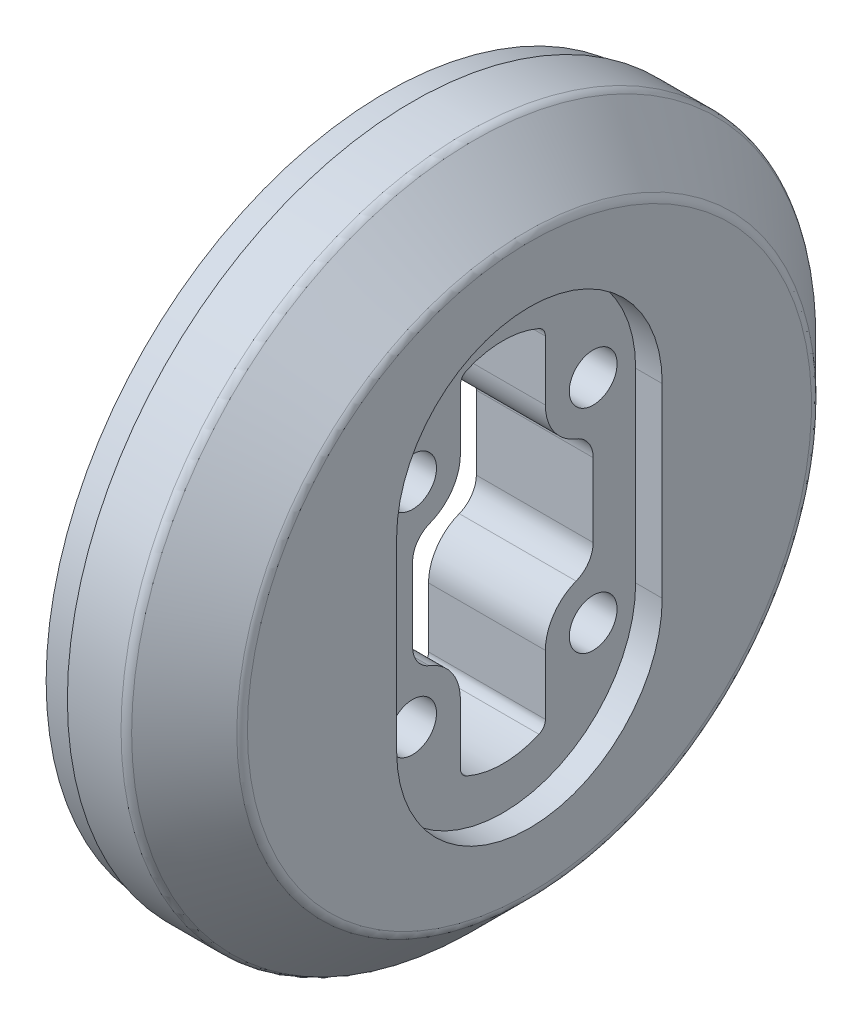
from build123d import *

# Parameters (mm, degrees)
SKIZZE2_R                       = 4.5
SCHNITT_LINEAR_AUSTRAGEN1_DEPTH = 5
SKIZZE3_R                       = 4.5
SCHNITT_LINEAR_AUSTRAGEN2_DEPTH = 96.807097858
SCHNITT_LINEAR_AUSTRAGEN3_DEPTH = 95.519839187


with BuildPart() as part:
    # Skizze1 → Rotation1 (revolve)
    with BuildSketch(Plane.XY, mode=Mode.PRIVATE) as rotation1_sk:
        with BuildLine():
            Line((0, 0), (0, 64))
            Line((0, 64), (5, 64))
            Line((5, 64), (5, 65))
            Line((5, 65), (15.1, 65))
            ThreePointArc((15.1, 65), (15.865366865, 64.847759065), (16.514213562, 64.414213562))
            Line((16.514213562, 64.414213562), (26.414213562, 54.514213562))
            ThreePointArc((26.414213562, 54.514213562), (26.847759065, 53.865366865), (27, 53.1))
            Line((27, 53.1), (27, 0))
            Line((27, 0), (0, 0))
        make_face()
    revolve(rotation1_sk.sketch.rotate(Axis((-23.952527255, 0, 0), (1, 0, 0)), 90), axis=Axis((-23.952527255, 0, 0), (1, 0, 0)))

    # Skizze2 → Schnitt-Linear austragen1 (cut)
    with BuildSketch(Plane(origin=(27, 0, 0), x_dir=(0, 0, -1), z_dir=(1, 0, 0))):
        with BuildLine():
            Line((-25, 17.5), (-25, -17.5))
            ThreePointArc((-25, -17.5), (0, -42.5), (25, -17.5))
            Line((25, -17.5), (25, 17.5))
            ThreePointArc((25, 17.5), (0, 42.5), (-25, 17.5))
        make_face()
        with Locations((-17, 20)):
            Circle(SKIZZE2_R, mode=Mode.SUBTRACT)
        with Locations((17, 20)):
            Circle(SKIZZE2_R, mode=Mode.SUBTRACT)
        with Locations((-17, -20)):
            Circle(SKIZZE2_R, mode=Mode.SUBTRACT)
        with Locations((17, -20)):
            Circle(SKIZZE2_R, mode=Mode.SUBTRACT)
    extrude(amount=-SCHNITT_LINEAR_AUSTRAGEN1_DEPTH, mode=Mode.SUBTRACT)

    # Skizze3 → Schnitt-Linear austragen2 (cut, through all)
    with BuildSketch(Plane(origin=(27, 0, 0), x_dir=(0, 0, -1), z_dir=(1, 0, 0))):
        with Locations((17, 20)):
            Circle(SKIZZE3_R)
        with Locations((-17, 20)):
            Circle(SKIZZE3_R)
        with Locations((-17, -20)):
            Circle(SKIZZE3_R)
        with Locations((17, -20)):
            Circle(SKIZZE3_R)
    extrude(amount=-SCHNITT_LINEAR_AUSTRAGEN2_DEPTH, mode=Mode.SUBTRACT)

    # Skizze4 → Schnitt-Linear austragen3 (cut, through all)
    with BuildSketch(Plane(origin=(22, 0, 0), x_dir=(0, 0, -1), z_dir=(1, 0, 0))):
        with BuildLine():
            Line((8.000000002, -31.247870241), (8.000000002, -20))
            ThreePointArc((8.000000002, -20), (9.586208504, -14.897477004), (13.785714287, -11.593547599))
            ThreePointArc((13.785714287, -11.593547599), (16.118772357, -9.758032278), (17.000000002, -6.923298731))
            Line((17.000000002, -6.923298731), (17.000000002, 6.923298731))
            ThreePointArc((17.000000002, 6.923298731), (16.118772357, 9.758032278), (13.785714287, 11.593547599))
            ThreePointArc((13.785714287, 11.593547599), (9.586208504, 14.897477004), (8.000000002, 20))
            Line((8.000000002, 20), (8.000000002, 31.247583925))
            ThreePointArc((8.000000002, 31.247583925), (7.673320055, 32.34302904), (6.800000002, 33.080614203))
            ThreePointArc((6.800000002, 33.080614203), (0, 34.499856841), (-6.800000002, 33.080614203))
            ThreePointArc((-6.800000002, 33.080614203), (-7.673320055, 32.34302904), (-8.000000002, 31.247583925))
            Line((-8.000000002, 31.247583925), (-8.000000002, 20))
            ThreePointArc((-8.000000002, 20), (-9.61487309, 14.856081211), (-13.879977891, 11.55811265))
            ThreePointArc((-13.879977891, 11.55811265), (-16.144077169, 9.722630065), (-17.000000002, 6.93649691))
            Line((-17.000000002, 6.93649691), (-17.000000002, -6.93649691))
            ThreePointArc((-17.000000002, -6.93649691), (-16.144077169, -9.722630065), (-13.879977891, -11.55811265))
            ThreePointArc((-13.879977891, -11.55811265), (-9.61487309, -14.856081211), (-8.000000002, -20))
            Line((-8.000000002, -20), (-8.000000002, -31.247870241))
            ThreePointArc((-8.000000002, -31.247870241), (-7.673320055, -32.343315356), (-6.800000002, -33.080900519))
            ThreePointArc((-6.800000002, -33.080900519), (0, -34.500143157), (6.800000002, -33.080900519))
            ThreePointArc((6.800000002, -33.080900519), (7.673320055, -32.343315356), (8.000000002, -31.247870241))
        make_face()
    extrude(amount=-SCHNITT_LINEAR_AUSTRAGEN3_DEPTH, mode=Mode.SUBTRACT)


solid = part.part
